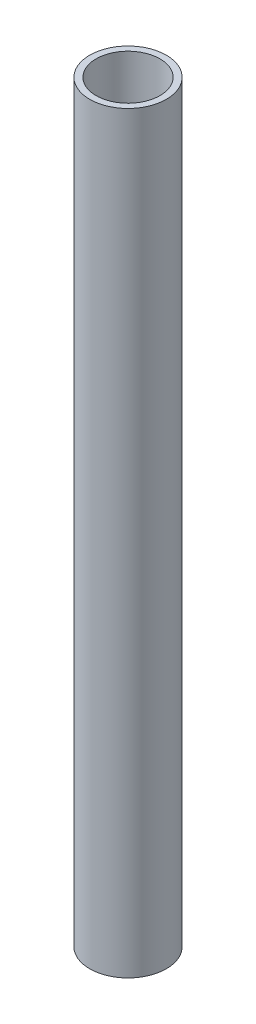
from build123d import *

# Parameters (mm, degrees)
SKETCH1_R           = 19.05
SKETCH1_R_2         = 15.875
BOSS_EXTRUDE1_DEPTH = 374.65


with BuildPart() as part:
    # Sketch1 → Boss-Extrude1 (new body)
    with BuildSketch(Plane(origin=(0, 0, 0), x_dir=(1, 0, 0), z_dir=(0, 1, 0))):
        with Locations(Location((0, 0, 0), (0, 0, 90))):
            Circle(SKETCH1_R)
        with Locations(Location((0, 0, 0), (0, 0, 90))):
            Circle(SKETCH1_R_2, mode=Mode.SUBTRACT)
    extrude(amount=BOSS_EXTRUDE1_DEPTH)


solid = part.part
